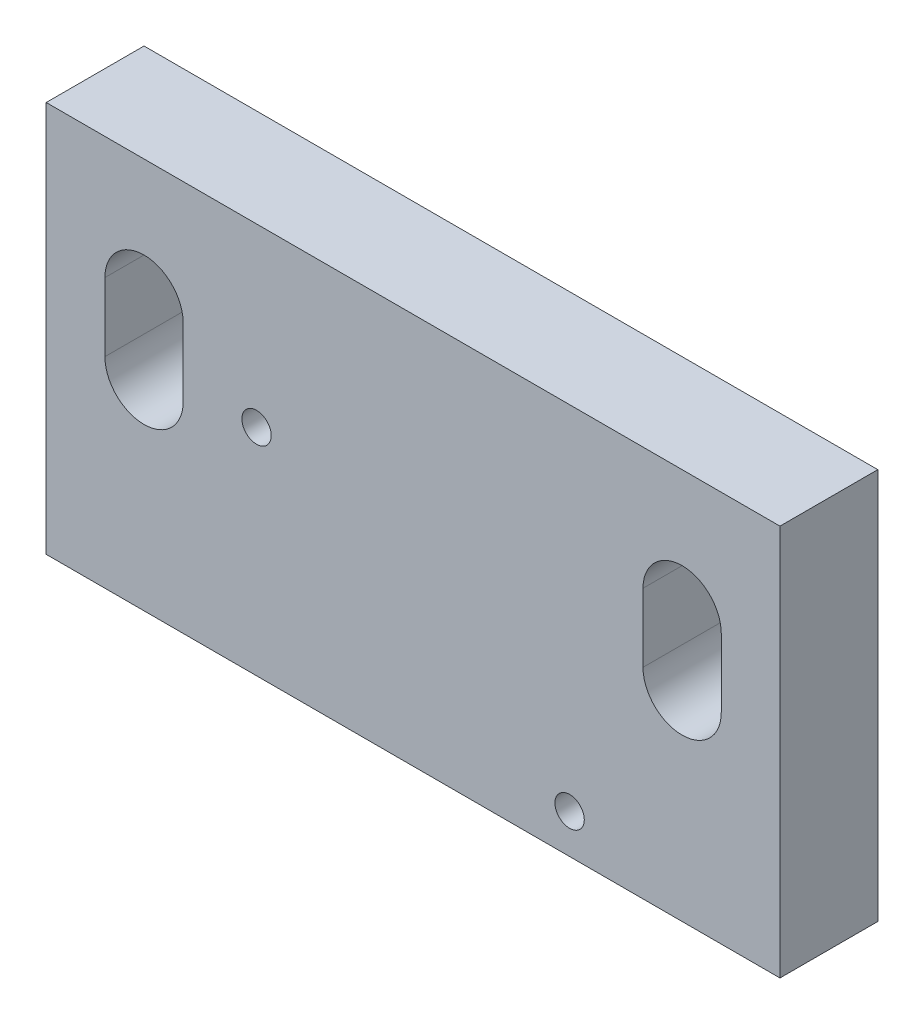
ISO-10303-21;
HEADER;
FILE_DESCRIPTION(('STEP AP214'),'2;1');
FILE_NAME('part.step','',(''),(''),'','','');
FILE_SCHEMA(('AUTOMOTIVE_DESIGN { 1 0 10303 214 1 1 1 1 }'));
ENDSEC;
DATA;
#1=APPLICATION_CONTEXT('core data for automotive mechanical design processes');
#2=APPLICATION_PROTOCOL_DEFINITION('international standard','automotive_design',2000,#1);
#3=PRODUCT_CONTEXT('',#1,'mechanical');
#4=PRODUCT('Part','Part','',(#3));
#5=PRODUCT_RELATED_PRODUCT_CATEGORY('part','',(#4));
#6=PRODUCT_DEFINITION_FORMATION('','',#4);
#7=PRODUCT_DEFINITION_CONTEXT('part definition',#1,'design');
#8=PRODUCT_DEFINITION('design','',#6,#7);
#9=PRODUCT_DEFINITION_SHAPE('','',#8);
#10=(LENGTH_UNIT() NAMED_UNIT(*) SI_UNIT(.MILLI.,.METRE.));
#11=(NAMED_UNIT(*) PLANE_ANGLE_UNIT() SI_UNIT($,.RADIAN.));
#12=(NAMED_UNIT(*) SI_UNIT($,.STERADIAN.) SOLID_ANGLE_UNIT());
#13=UNCERTAINTY_MEASURE_WITH_UNIT(LENGTH_MEASURE(1.E-05),#10,'distance_accuracy_value','');
#14=(GEOMETRIC_REPRESENTATION_CONTEXT(3) GLOBAL_UNCERTAINTY_ASSIGNED_CONTEXT((#13)) GLOBAL_UNIT_ASSIGNED_CONTEXT((#10,
#11,#12)) REPRESENTATION_CONTEXT('',''));
#15=CARTESIAN_POINT('',(0.,0.,0.));
#16=DIRECTION('',(0.,0.,1.));
#17=DIRECTION('',(1.,0.,0.));
#18=AXIS2_PLACEMENT_3D('',#15,#16,#17);
#19=CARTESIAN_POINT('',(0.,0.,0.));
#20=DIRECTION('',(0.,0.,1.));
#21=DIRECTION('',(1.,0.,0.));
#22=AXIS2_PLACEMENT_3D('',#19,#20,#21);
#23=PLANE('',#22);
#24=CARTESIAN_POINT('',(16.,-16.,0.));
#25=DIRECTION('',(0.,0.,1.));
#26=DIRECTION('',(1.,0.,0.));
#27=AXIS2_PLACEMENT_3D('',#24,#25,#26);
#28=CIRCLE('',#27,1.5);
#29=CARTESIAN_POINT('',(17.5,-16.,0.));
#30=VERTEX_POINT('',#29);
#31=EDGE_CURVE('E160',#30,#30,#28,.T.);
#32=ORIENTED_EDGE('',*,*,#31,.T.);
#33=EDGE_LOOP('',(#32));
#34=FACE_BOUND('',#33,.T.);
#35=CARTESIAN_POINT('',(-16.,2.,0.));
#36=DIRECTION('',(0.,0.,1.));
#37=DIRECTION('',(1.,0.,0.));
#38=AXIS2_PLACEMENT_3D('',#35,#36,#37);
#39=CIRCLE('',#38,1.5);
#40=CARTESIAN_POINT('',(-14.5,2.,0.));
#41=VERTEX_POINT('',#40);
#42=EDGE_CURVE('E164',#41,#41,#39,.T.);
#43=ORIENTED_EDGE('',*,*,#42,.T.);
#44=EDGE_LOOP('',(#43));
#45=FACE_BOUND('',#44,.T.);
#46=CARTESIAN_POINT('',(27.5,0.5,0.));
#47=DIRECTION('',(0.,0.,1.));
#48=DIRECTION('',(1.,0.,0.));
#49=AXIS2_PLACEMENT_3D('',#46,#47,#48);
#50=CIRCLE('',#49,4.);
#51=CARTESIAN_POINT('',(23.5,0.5,0.));
#52=VERTEX_POINT('',#51);
#53=CARTESIAN_POINT('',(31.5,0.5,0.));
#54=VERTEX_POINT('',#53);
#55=EDGE_CURVE('E167',#52,#54,#50,.T.);
#56=ORIENTED_EDGE('',*,*,#55,.T.);
#57=DIRECTION('',(0.,1.,0.));
#58=VECTOR('',#57,1.);
#59=CARTESIAN_POINT('',(31.5,7.5,0.));
#60=LINE('',#59,#58);
#61=CARTESIAN_POINT('',(31.5,7.5,0.));
#62=VERTEX_POINT('',#61);
#63=EDGE_CURVE('E129',#54,#62,#60,.T.);
#64=ORIENTED_EDGE('',*,*,#63,.T.);
#65=CARTESIAN_POINT('',(27.5,7.5,0.));
#66=DIRECTION('',(0.,0.,1.));
#67=DIRECTION('',(1.,0.,0.));
#68=AXIS2_PLACEMENT_3D('',#65,#66,#67);
#69=CIRCLE('',#68,4.);
#70=CARTESIAN_POINT('',(23.5,7.5,0.));
#71=VERTEX_POINT('',#70);
#72=EDGE_CURVE('E135',#62,#71,#69,.T.);
#73=ORIENTED_EDGE('',*,*,#72,.T.);
#74=DIRECTION('',(0.,1.,0.));
#75=VECTOR('',#74,1.);
#76=CARTESIAN_POINT('',(23.5,0.5,0.));
#77=LINE('',#76,#75);
#78=EDGE_CURVE('E133',#71,#52,#77,.F.);
#79=ORIENTED_EDGE('',*,*,#78,.T.);
#80=EDGE_LOOP('',(#56,#64,#73,#79));
#81=FACE_BOUND('',#80,.T.);
#82=CARTESIAN_POINT('',(-27.5,0.5,0.));
#83=DIRECTION('',(0.,0.,1.));
#84=DIRECTION('',(1.,0.,0.));
#85=AXIS2_PLACEMENT_3D('',#82,#83,#84);
#86=CIRCLE('',#85,4.);
#87=CARTESIAN_POINT('',(-31.5,0.5,0.));
#88=VERTEX_POINT('',#87);
#89=CARTESIAN_POINT('',(-23.5,0.5,0.));
#90=VERTEX_POINT('',#89);
#91=EDGE_CURVE('E170',#88,#90,#86,.T.);
#92=ORIENTED_EDGE('',*,*,#91,.T.);
#93=DIRECTION('',(0.,1.,0.));
#94=VECTOR('',#93,1.);
#95=CARTESIAN_POINT('',(-23.5,7.5,0.));
#96=LINE('',#95,#94);
#97=CARTESIAN_POINT('',(-23.5,7.5,0.));
#98=VERTEX_POINT('',#97);
#99=EDGE_CURVE('E83',#90,#98,#96,.T.);
#100=ORIENTED_EDGE('',*,*,#99,.T.);
#101=CARTESIAN_POINT('',(-27.5,7.5,0.));
#102=DIRECTION('',(0.,0.,1.));
#103=DIRECTION('',(1.,0.,0.));
#104=AXIS2_PLACEMENT_3D('',#101,#102,#103);
#105=CIRCLE('',#104,4.);
#106=CARTESIAN_POINT('',(-31.5,7.5,0.));
#107=VERTEX_POINT('',#106);
#108=EDGE_CURVE('E18',#98,#107,#105,.T.);
#109=ORIENTED_EDGE('',*,*,#108,.T.);
#110=DIRECTION('',(0.,1.,0.));
#111=VECTOR('',#110,1.);
#112=CARTESIAN_POINT('',(-31.5,0.5,0.));
#113=LINE('',#112,#111);
#114=EDGE_CURVE('E140',#107,#88,#113,.F.);
#115=ORIENTED_EDGE('',*,*,#114,.T.);
#116=EDGE_LOOP('',(#92,#100,#109,#115));
#117=FACE_BOUND('',#116,.T.);
#118=DIRECTION('',(1.,0.,0.));
#119=VECTOR('',#118,1.);
#120=CARTESIAN_POINT('',(37.5,-20.,0.));
#121=LINE('',#120,#119);
#122=CARTESIAN_POINT('',(-37.5,-20.,0.));
#123=VERTEX_POINT('',#122);
#124=CARTESIAN_POINT('',(37.5,-20.,0.));
#125=VERTEX_POINT('',#124);
#126=EDGE_CURVE('E94',#123,#125,#121,.T.);
#127=ORIENTED_EDGE('',*,*,#126,.F.);
#128=DIRECTION('',(0.,1.,0.));
#129=VECTOR('',#128,1.);
#130=CARTESIAN_POINT('',(-37.5,-20.,0.));
#131=LINE('',#130,#129);
#132=CARTESIAN_POINT('',(-37.5,20.,0.));
#133=VERTEX_POINT('',#132);
#134=EDGE_CURVE('E183',#133,#123,#131,.F.);
#135=ORIENTED_EDGE('',*,*,#134,.F.);
#136=DIRECTION('',(1.,0.,0.));
#137=VECTOR('',#136,1.);
#138=CARTESIAN_POINT('',(-37.5,20.,0.));
#139=LINE('',#138,#137);
#140=CARTESIAN_POINT('',(37.5,20.,0.));
#141=VERTEX_POINT('',#140);
#142=EDGE_CURVE('E118',#141,#133,#139,.F.);
#143=ORIENTED_EDGE('',*,*,#142,.F.);
#144=DIRECTION('',(0.,1.,0.));
#145=VECTOR('',#144,1.);
#146=CARTESIAN_POINT('',(37.5,20.,0.));
#147=LINE('',#146,#145);
#148=EDGE_CURVE('E106',#125,#141,#147,.T.);
#149=ORIENTED_EDGE('',*,*,#148,.F.);
#150=EDGE_LOOP('',(#127,#135,#143,#149));
#151=FACE_BOUND('',#150,.T.);
#152=ADVANCED_FACE('F15',(#34,#45,#81,#117,#151),#23,.F.);
#153=CARTESIAN_POINT('',(37.5,-20.,0.));
#154=DIRECTION('',(0.,-1.,0.));
#155=DIRECTION('',(0.,0.,-1.));
#156=AXIS2_PLACEMENT_3D('',#153,#154,#155);
#157=PLANE('',#156);
#158=ORIENTED_EDGE('',*,*,#126,.T.);
#159=DIRECTION('',(0.,0.,-1.));
#160=VECTOR('',#159,1.);
#161=CARTESIAN_POINT('',(37.5,-20.,0.));
#162=LINE('',#161,#160);
#163=CARTESIAN_POINT('',(37.5,-20.,10.));
#164=VERTEX_POINT('',#163);
#165=EDGE_CURVE('E112',#164,#125,#162,.T.);
#166=ORIENTED_EDGE('',*,*,#165,.F.);
#167=DIRECTION('',(1.,0.,0.));
#168=VECTOR('',#167,1.);
#169=CARTESIAN_POINT('',(0.,-20.,10.));
#170=LINE('',#169,#168);
#171=CARTESIAN_POINT('',(-37.5,-20.,10.));
#172=VERTEX_POINT('',#171);
#173=EDGE_CURVE('E163',#172,#164,#170,.T.);
#174=ORIENTED_EDGE('',*,*,#173,.F.);
#175=DIRECTION('',(0.,0.,1.));
#176=VECTOR('',#175,1.);
#177=CARTESIAN_POINT('',(-37.5,-20.,0.));
#178=LINE('',#177,#176);
#179=EDGE_CURVE('E115',#123,#172,#178,.T.);
#180=ORIENTED_EDGE('',*,*,#179,.F.);
#181=EDGE_LOOP('',(#158,#166,#174,#180));
#182=FACE_BOUND('',#181,.T.);
#183=ADVANCED_FACE('F110',(#182),#157,.T.);
#184=CARTESIAN_POINT('',(37.5,20.,0.));
#185=DIRECTION('',(1.,0.,0.));
#186=DIRECTION('',(0.,0.,-1.));
#187=AXIS2_PLACEMENT_3D('',#184,#185,#186);
#188=PLANE('',#187);
#189=ORIENTED_EDGE('',*,*,#148,.T.);
#190=DIRECTION('',(0.,0.,1.));
#191=VECTOR('',#190,1.);
#192=CARTESIAN_POINT('',(37.5,20.,0.));
#193=LINE('',#192,#191);
#194=CARTESIAN_POINT('',(37.5,20.,10.));
#195=VERTEX_POINT('',#194);
#196=EDGE_CURVE('E120',#195,#141,#193,.F.);
#197=ORIENTED_EDGE('',*,*,#196,.F.);
#198=DIRECTION('',(0.,1.,0.));
#199=VECTOR('',#198,1.);
#200=CARTESIAN_POINT('',(37.5,0.,10.));
#201=LINE('',#200,#199);
#202=EDGE_CURVE('E124',#164,#195,#201,.T.);
#203=ORIENTED_EDGE('',*,*,#202,.F.);
#204=ORIENTED_EDGE('',*,*,#165,.T.);
#205=EDGE_LOOP('',(#189,#197,#203,#204));
#206=FACE_BOUND('',#205,.T.);
#207=ADVANCED_FACE('F122',(#206),#188,.T.);
#208=CARTESIAN_POINT('',(-37.5,20.,0.));
#209=DIRECTION('',(0.,1.,0.));
#210=DIRECTION('',(0.,0.,1.));
#211=AXIS2_PLACEMENT_3D('',#208,#209,#210);
#212=PLANE('',#211);
#213=ORIENTED_EDGE('',*,*,#142,.T.);
#214=DIRECTION('',(0.,0.,1.));
#215=VECTOR('',#214,1.);
#216=CARTESIAN_POINT('',(-37.5,20.,0.));
#217=LINE('',#216,#215);
#218=CARTESIAN_POINT('',(-37.5,20.,10.));
#219=VERTEX_POINT('',#218);
#220=EDGE_CURVE('E185',#219,#133,#217,.F.);
#221=ORIENTED_EDGE('',*,*,#220,.F.);
#222=DIRECTION('',(1.,0.,0.));
#223=VECTOR('',#222,1.);
#224=CARTESIAN_POINT('',(0.,20.,10.));
#225=LINE('',#224,#223);
#226=EDGE_CURVE('E194',#195,#219,#225,.F.);
#227=ORIENTED_EDGE('',*,*,#226,.F.);
#228=ORIENTED_EDGE('',*,*,#196,.T.);
#229=EDGE_LOOP('',(#213,#221,#227,#228));
#230=FACE_BOUND('',#229,.T.);
#231=ADVANCED_FACE('F190',(#230),#212,.T.);
#232=CARTESIAN_POINT('',(-37.5,-20.,0.));
#233=DIRECTION('',(-1.,0.,0.));
#234=DIRECTION('',(0.,0.,1.));
#235=AXIS2_PLACEMENT_3D('',#232,#233,#234);
#236=PLANE('',#235);
#237=ORIENTED_EDGE('',*,*,#134,.T.);
#238=ORIENTED_EDGE('',*,*,#179,.T.);
#239=DIRECTION('',(0.,1.,0.));
#240=VECTOR('',#239,1.);
#241=CARTESIAN_POINT('',(-37.5,0.,10.));
#242=LINE('',#241,#240);
#243=EDGE_CURVE('E203',#219,#172,#242,.F.);
#244=ORIENTED_EDGE('',*,*,#243,.F.);
#245=ORIENTED_EDGE('',*,*,#220,.T.);
#246=EDGE_LOOP('',(#237,#238,#244,#245));
#247=FACE_BOUND('',#246,.T.);
#248=ADVANCED_FACE('F202',(#247),#236,.T.);
#249=CARTESIAN_POINT('',(-31.5,0.5,0.));
#250=DIRECTION('',(-1.,0.,0.));
#251=DIRECTION('',(0.,0.,1.));
#252=AXIS2_PLACEMENT_3D('',#249,#250,#251);
#253=PLANE('',#252);
#254=DIRECTION('',(0.,0.,1.));
#255=VECTOR('',#254,1.);
#256=CARTESIAN_POINT('',(-31.5,0.500000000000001,0.));
#257=LINE('',#256,#255);
#258=CARTESIAN_POINT('',(-31.5,0.5,10.));
#259=VERTEX_POINT('',#258);
#260=EDGE_CURVE('E171',#259,#88,#257,.F.);
#261=ORIENTED_EDGE('',*,*,#260,.T.);
#262=ORIENTED_EDGE('',*,*,#114,.F.);
#263=DIRECTION('',(0.,0.,1.));
#264=VECTOR('',#263,1.);
#265=CARTESIAN_POINT('',(-31.5,7.5,0.));
#266=LINE('',#265,#264);
#267=CARTESIAN_POINT('',(-31.5,7.5,10.));
#268=VERTEX_POINT('',#267);
#269=EDGE_CURVE('E139',#107,#268,#266,.T.);
#270=ORIENTED_EDGE('',*,*,#269,.T.);
#271=DIRECTION('',(0.,1.,0.));
#272=VECTOR('',#271,1.);
#273=CARTESIAN_POINT('',(-31.5,0.,10.));
#274=LINE('',#273,#272);
#275=EDGE_CURVE('E159',#259,#268,#274,.T.);
#276=ORIENTED_EDGE('',*,*,#275,.F.);
#277=EDGE_LOOP('',(#261,#262,#270,#276));
#278=FACE_BOUND('',#277,.T.);
#279=ADVANCED_FACE('F316',(#278),#253,.F.);
#280=CARTESIAN_POINT('',(-27.5,7.5,0.));
#281=DIRECTION('',(0.,0.,1.));
#282=DIRECTION('',(1.,0.,0.));
#283=AXIS2_PLACEMENT_3D('',#280,#281,#282);
#284=CYLINDRICAL_SURFACE('',#283,4.);
#285=ORIENTED_EDGE('',*,*,#269,.F.);
#286=ORIENTED_EDGE('',*,*,#108,.F.);
#287=DIRECTION('',(0.,0.,-1.));
#288=VECTOR('',#287,1.);
#289=CARTESIAN_POINT('',(-23.5,7.5,0.));
#290=LINE('',#289,#288);
#291=CARTESIAN_POINT('',(-23.5,7.5,10.));
#292=VERTEX_POINT('',#291);
#293=EDGE_CURVE('E138',#98,#292,#290,.F.);
#294=ORIENTED_EDGE('',*,*,#293,.T.);
#295=CARTESIAN_POINT('',(-27.5,7.5,10.));
#296=DIRECTION('',(0.,0.,1.));
#297=DIRECTION('',(1.,0.,0.));
#298=AXIS2_PLACEMENT_3D('',#295,#296,#297);
#299=CIRCLE('',#298,4.);
#300=EDGE_CURVE('E156',#268,#292,#299,.F.);
#301=ORIENTED_EDGE('',*,*,#300,.F.);
#302=EDGE_LOOP('',(#285,#286,#294,#301));
#303=FACE_BOUND('',#302,.T.);
#304=ADVANCED_FACE('F249',(#303),#284,.F.);
#305=CARTESIAN_POINT('',(-23.5,7.5,0.));
#306=DIRECTION('',(1.,0.,0.));
#307=DIRECTION('',(0.,0.,-1.));
#308=AXIS2_PLACEMENT_3D('',#305,#306,#307);
#309=PLANE('',#308);
#310=ORIENTED_EDGE('',*,*,#293,.F.);
#311=ORIENTED_EDGE('',*,*,#99,.F.);
#312=DIRECTION('',(0.,0.,1.));
#313=VECTOR('',#312,1.);
#314=CARTESIAN_POINT('',(-23.5,0.5,0.));
#315=LINE('',#314,#313);
#316=CARTESIAN_POINT('',(-23.5,0.5,10.));
#317=VERTEX_POINT('',#316);
#318=EDGE_CURVE('E136',#90,#317,#315,.T.);
#319=ORIENTED_EDGE('',*,*,#318,.T.);
#320=DIRECTION('',(0.,1.,0.));
#321=VECTOR('',#320,1.);
#322=CARTESIAN_POINT('',(-23.5,0.,10.));
#323=LINE('',#322,#321);
#324=EDGE_CURVE('E155',#292,#317,#323,.F.);
#325=ORIENTED_EDGE('',*,*,#324,.F.);
#326=EDGE_LOOP('',(#310,#311,#319,#325));
#327=FACE_BOUND('',#326,.T.);
#328=ADVANCED_FACE('F237',(#327),#309,.F.);
#329=CARTESIAN_POINT('',(-27.5,0.5,0.));
#330=DIRECTION('',(0.,0.,1.));
#331=DIRECTION('',(1.,0.,0.));
#332=AXIS2_PLACEMENT_3D('',#329,#330,#331);
#333=CYLINDRICAL_SURFACE('',#332,4.);
#334=ORIENTED_EDGE('',*,*,#318,.F.);
#335=ORIENTED_EDGE('',*,*,#91,.F.);
#336=ORIENTED_EDGE('',*,*,#260,.F.);
#337=CARTESIAN_POINT('',(-27.5,0.5,10.));
#338=DIRECTION('',(0.,0.,1.));
#339=DIRECTION('',(1.,0.,0.));
#340=AXIS2_PLACEMENT_3D('',#337,#338,#339);
#341=CIRCLE('',#340,4.);
#342=EDGE_CURVE('E152',#317,#259,#341,.F.);
#343=ORIENTED_EDGE('',*,*,#342,.F.);
#344=EDGE_LOOP('',(#334,#335,#336,#343));
#345=FACE_BOUND('',#344,.T.);
#346=ADVANCED_FACE('F240',(#345),#333,.F.);
#347=CARTESIAN_POINT('',(23.5,0.5,0.));
#348=DIRECTION('',(-1.,0.,0.));
#349=DIRECTION('',(0.,0.,1.));
#350=AXIS2_PLACEMENT_3D('',#347,#348,#349);
#351=PLANE('',#350);
#352=DIRECTION('',(0.,0.,1.));
#353=VECTOR('',#352,1.);
#354=CARTESIAN_POINT('',(23.5,0.500000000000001,0.));
#355=LINE('',#354,#353);
#356=CARTESIAN_POINT('',(23.5,0.5,10.));
#357=VERTEX_POINT('',#356);
#358=EDGE_CURVE('E169',#357,#52,#355,.F.);
#359=ORIENTED_EDGE('',*,*,#358,.T.);
#360=ORIENTED_EDGE('',*,*,#78,.F.);
#361=DIRECTION('',(0.,0.,1.));
#362=VECTOR('',#361,1.);
#363=CARTESIAN_POINT('',(23.5,7.5,0.));
#364=LINE('',#363,#362);
#365=CARTESIAN_POINT('',(23.5,7.5,10.));
#366=VERTEX_POINT('',#365);
#367=EDGE_CURVE('E132',#71,#366,#364,.T.);
#368=ORIENTED_EDGE('',*,*,#367,.T.);
#369=DIRECTION('',(0.,1.,0.));
#370=VECTOR('',#369,1.);
#371=CARTESIAN_POINT('',(23.5,0.,10.));
#372=LINE('',#371,#370);
#373=EDGE_CURVE('E151',#357,#366,#372,.T.);
#374=ORIENTED_EDGE('',*,*,#373,.F.);
#375=EDGE_LOOP('',(#359,#360,#368,#374));
#376=FACE_BOUND('',#375,.T.);
#377=ADVANCED_FACE('F219',(#376),#351,.F.);
#378=CARTESIAN_POINT('',(27.5,7.5,0.));
#379=DIRECTION('',(0.,0.,1.));
#380=DIRECTION('',(1.,0.,0.));
#381=AXIS2_PLACEMENT_3D('',#378,#379,#380);
#382=CYLINDRICAL_SURFACE('',#381,4.);
#383=ORIENTED_EDGE('',*,*,#367,.F.);
#384=ORIENTED_EDGE('',*,*,#72,.F.);
#385=DIRECTION('',(0.,0.,-1.));
#386=VECTOR('',#385,1.);
#387=CARTESIAN_POINT('',(31.5,7.5,0.));
#388=LINE('',#387,#386);
#389=CARTESIAN_POINT('',(31.5,7.5,10.));
#390=VERTEX_POINT('',#389);
#391=EDGE_CURVE('E131',#62,#390,#388,.F.);
#392=ORIENTED_EDGE('',*,*,#391,.T.);
#393=CARTESIAN_POINT('',(27.5,7.5,10.));
#394=DIRECTION('',(0.,0.,1.));
#395=DIRECTION('',(1.,0.,0.));
#396=AXIS2_PLACEMENT_3D('',#393,#394,#395);
#397=CIRCLE('',#396,4.);
#398=EDGE_CURVE('E148',#366,#390,#397,.F.);
#399=ORIENTED_EDGE('',*,*,#398,.F.);
#400=EDGE_LOOP('',(#383,#384,#392,#399));
#401=FACE_BOUND('',#400,.T.);
#402=ADVANCED_FACE('F224',(#401),#382,.F.);
#403=CARTESIAN_POINT('',(31.5,7.5,0.));
#404=DIRECTION('',(1.,0.,0.));
#405=DIRECTION('',(0.,0.,-1.));
#406=AXIS2_PLACEMENT_3D('',#403,#404,#405);
#407=PLANE('',#406);
#408=ORIENTED_EDGE('',*,*,#391,.F.);
#409=ORIENTED_EDGE('',*,*,#63,.F.);
#410=DIRECTION('',(0.,0.,1.));
#411=VECTOR('',#410,1.);
#412=CARTESIAN_POINT('',(31.5,0.5,0.));
#413=LINE('',#412,#411);
#414=CARTESIAN_POINT('',(31.5,0.5,10.));
#415=VERTEX_POINT('',#414);
#416=EDGE_CURVE('E33',#54,#415,#413,.T.);
#417=ORIENTED_EDGE('',*,*,#416,.T.);
#418=DIRECTION('',(0.,1.,0.));
#419=VECTOR('',#418,1.);
#420=CARTESIAN_POINT('',(31.5,0.,10.));
#421=LINE('',#420,#419);
#422=EDGE_CURVE('E147',#390,#415,#421,.F.);
#423=ORIENTED_EDGE('',*,*,#422,.F.);
#424=EDGE_LOOP('',(#408,#409,#417,#423));
#425=FACE_BOUND('',#424,.T.);
#426=ADVANCED_FACE('F269',(#425),#407,.F.);
#427=CARTESIAN_POINT('',(27.5,0.5,0.));
#428=DIRECTION('',(0.,0.,1.));
#429=DIRECTION('',(1.,0.,0.));
#430=AXIS2_PLACEMENT_3D('',#427,#428,#429);
#431=CYLINDRICAL_SURFACE('',#430,4.);
#432=ORIENTED_EDGE('',*,*,#416,.F.);
#433=ORIENTED_EDGE('',*,*,#55,.F.);
#434=ORIENTED_EDGE('',*,*,#358,.F.);
#435=CARTESIAN_POINT('',(27.5,0.5,10.));
#436=DIRECTION('',(0.,0.,1.));
#437=DIRECTION('',(1.,0.,0.));
#438=AXIS2_PLACEMENT_3D('',#435,#436,#437);
#439=CIRCLE('',#438,4.);
#440=EDGE_CURVE('E144',#415,#357,#439,.F.);
#441=ORIENTED_EDGE('',*,*,#440,.F.);
#442=EDGE_LOOP('',(#432,#433,#434,#441));
#443=FACE_BOUND('',#442,.T.);
#444=ADVANCED_FACE('F265',(#443),#431,.F.);
#445=CARTESIAN_POINT('',(-16.,2.,0.));
#446=DIRECTION('',(0.,0.,1.));
#447=DIRECTION('',(1.,0.,0.));
#448=AXIS2_PLACEMENT_3D('',#445,#446,#447);
#449=CYLINDRICAL_SURFACE('',#448,1.5);
#450=ORIENTED_EDGE('',*,*,#42,.F.);
#451=EDGE_LOOP('',(#450));
#452=FACE_BOUND('',#451,.T.);
#453=CARTESIAN_POINT('',(-16.,2.,10.));
#454=DIRECTION('',(0.,0.,1.));
#455=DIRECTION('',(1.,0.,0.));
#456=AXIS2_PLACEMENT_3D('',#453,#454,#455);
#457=CIRCLE('',#456,1.5);
#458=CARTESIAN_POINT('',(-14.5,2.,10.));
#459=VERTEX_POINT('',#458);
#460=EDGE_CURVE('E24',#459,#459,#457,.F.);
#461=ORIENTED_EDGE('',*,*,#460,.F.);
#462=EDGE_LOOP('',(#461));
#463=FACE_BOUND('',#462,.T.);
#464=ADVANCED_FACE('F258',(#452,#463),#449,.F.);
#465=CARTESIAN_POINT('',(16.,-16.,0.));
#466=DIRECTION('',(0.,0.,1.));
#467=DIRECTION('',(1.,0.,0.));
#468=AXIS2_PLACEMENT_3D('',#465,#466,#467);
#469=CYLINDRICAL_SURFACE('',#468,1.5);
#470=ORIENTED_EDGE('',*,*,#31,.F.);
#471=EDGE_LOOP('',(#470));
#472=FACE_BOUND('',#471,.T.);
#473=CARTESIAN_POINT('',(16.,-16.,10.));
#474=DIRECTION('',(0.,0.,1.));
#475=DIRECTION('',(1.,0.,0.));
#476=AXIS2_PLACEMENT_3D('',#473,#474,#475);
#477=CIRCLE('',#476,1.5);
#478=CARTESIAN_POINT('',(17.5,-16.,10.));
#479=VERTEX_POINT('',#478);
#480=EDGE_CURVE('E10',#479,#479,#477,.F.);
#481=ORIENTED_EDGE('',*,*,#480,.F.);
#482=EDGE_LOOP('',(#481));
#483=FACE_BOUND('',#482,.T.);
#484=ADVANCED_FACE('F252',(#472,#483),#469,.F.);
#485=CARTESIAN_POINT('',(0.,0.,10.));
#486=DIRECTION('',(0.,0.,1.));
#487=DIRECTION('',(1.,0.,0.));
#488=AXIS2_PLACEMENT_3D('',#485,#486,#487);
#489=PLANE('',#488);
#490=ORIENTED_EDGE('',*,*,#480,.T.);
#491=EDGE_LOOP('',(#490));
#492=FACE_BOUND('',#491,.T.);
#493=ORIENTED_EDGE('',*,*,#460,.T.);
#494=EDGE_LOOP('',(#493));
#495=FACE_BOUND('',#494,.T.);
#496=ORIENTED_EDGE('',*,*,#422,.T.);
#497=ORIENTED_EDGE('',*,*,#440,.T.);
#498=ORIENTED_EDGE('',*,*,#373,.T.);
#499=ORIENTED_EDGE('',*,*,#398,.T.);
#500=EDGE_LOOP('',(#496,#497,#498,#499));
#501=FACE_BOUND('',#500,.T.);
#502=ORIENTED_EDGE('',*,*,#324,.T.);
#503=ORIENTED_EDGE('',*,*,#342,.T.);
#504=ORIENTED_EDGE('',*,*,#275,.T.);
#505=ORIENTED_EDGE('',*,*,#300,.T.);
#506=EDGE_LOOP('',(#502,#503,#504,#505));
#507=FACE_BOUND('',#506,.T.);
#508=ORIENTED_EDGE('',*,*,#226,.T.);
#509=ORIENTED_EDGE('',*,*,#243,.T.);
#510=ORIENTED_EDGE('',*,*,#173,.T.);
#511=ORIENTED_EDGE('',*,*,#202,.T.);
#512=EDGE_LOOP('',(#508,#509,#510,#511));
#513=FACE_BOUND('',#512,.T.);
#514=ADVANCED_FACE('F204',(#492,#495,#501,#507,#513),#489,.T.);
#515=CLOSED_SHELL('',(#152,#183,#207,#231,#248,#279,#304,#328,#346,#377,#402,#426,#444,#464,
#484,#514));
#516=MANIFOLD_SOLID_BREP('B1',#515);
#517=ADVANCED_BREP_SHAPE_REPRESENTATION('',(#18,#516),#14);
#518=SHAPE_DEFINITION_REPRESENTATION(#9,#517);
ENDSEC;
END-ISO-10303-21;
